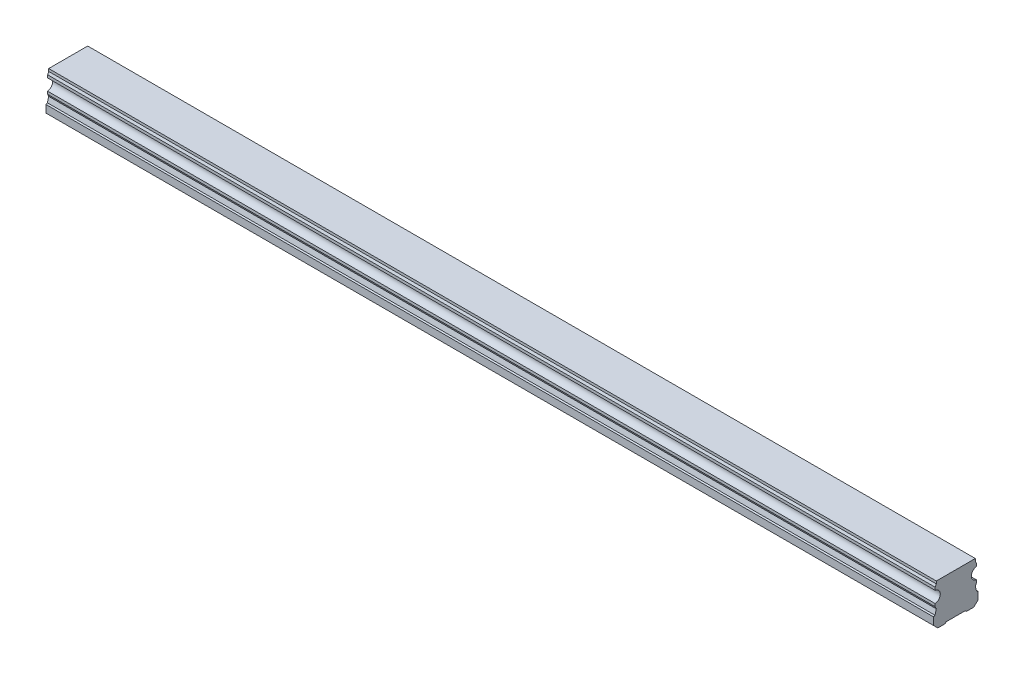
ISO-10303-21;
HEADER;
FILE_DESCRIPTION(('STEP AP214'),'2;1');
FILE_NAME('part.step','',(''),(''),'','','');
FILE_SCHEMA(('AUTOMOTIVE_DESIGN { 1 0 10303 214 1 1 1 1 }'));
ENDSEC;
DATA;
#1=APPLICATION_CONTEXT('core data for automotive mechanical design processes');
#2=APPLICATION_PROTOCOL_DEFINITION('international standard','automotive_design',2000,#1);
#3=PRODUCT_CONTEXT('',#1,'mechanical');
#4=PRODUCT('Part','Part','',(#3));
#5=PRODUCT_RELATED_PRODUCT_CATEGORY('part','',(#4));
#6=PRODUCT_DEFINITION_FORMATION('','',#4);
#7=PRODUCT_DEFINITION_CONTEXT('part definition',#1,'design');
#8=PRODUCT_DEFINITION('design','',#6,#7);
#9=PRODUCT_DEFINITION_SHAPE('','',#8);
#10=(LENGTH_UNIT() NAMED_UNIT(*) SI_UNIT(.MILLI.,.METRE.));
#11=(NAMED_UNIT(*) PLANE_ANGLE_UNIT() SI_UNIT($,.RADIAN.));
#12=(NAMED_UNIT(*) SI_UNIT($,.STERADIAN.) SOLID_ANGLE_UNIT());
#13=UNCERTAINTY_MEASURE_WITH_UNIT(LENGTH_MEASURE(1.E-05),#10,'distance_accuracy_value','');
#14=(GEOMETRIC_REPRESENTATION_CONTEXT(3) GLOBAL_UNCERTAINTY_ASSIGNED_CONTEXT((#13)) GLOBAL_UNIT_ASSIGNED_CONTEXT((#10,
#11,#12)) REPRESENTATION_CONTEXT('',''));
#15=CARTESIAN_POINT('',(0.,0.,0.));
#16=DIRECTION('',(0.,0.,1.));
#17=DIRECTION('',(1.,0.,0.));
#18=AXIS2_PLACEMENT_3D('',#15,#16,#17);
#19=CARTESIAN_POINT('',(270.,0.399999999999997,0.));
#20=DIRECTION('',(0.,-1.,0.));
#21=DIRECTION('',(0.,0.,-1.));
#22=AXIS2_PLACEMENT_3D('',#19,#20,#21);
#23=CONICAL_SURFACE('',#22,2.89999999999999,0.785398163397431);
#24=CARTESIAN_POINT('',(270.,0.799999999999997,0.));
#25=DIRECTION('',(0.,1.,0.));
#26=DIRECTION('',(0.,0.,1.));
#27=AXIS2_PLACEMENT_3D('',#24,#25,#26);
#28=CIRCLE('',#27,2.5);
#29=CARTESIAN_POINT('',(270.,0.799999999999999,2.5));
#30=VERTEX_POINT('',#29);
#31=EDGE_CURVE('E11',#30,#30,#28,.F.);
#32=ORIENTED_EDGE('',*,*,#31,.F.);
#33=EDGE_LOOP('',(#32));
#34=FACE_BOUND('',#33,.T.);
#35=CARTESIAN_POINT('',(270.,0.399999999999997,0.));
#36=DIRECTION('',(0.,1.,0.));
#37=DIRECTION('',(0.,0.,1.));
#38=AXIS2_PLACEMENT_3D('',#35,#36,#37);
#39=CIRCLE('',#38,2.89999999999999);
#40=CARTESIAN_POINT('',(270.,0.399999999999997,2.89999999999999));
#41=VERTEX_POINT('',#40);
#42=EDGE_CURVE('E457',#41,#41,#39,.T.);
#43=ORIENTED_EDGE('',*,*,#42,.F.);
#44=EDGE_LOOP('',(#43));
#45=FACE_BOUND('',#44,.T.);
#46=ADVANCED_FACE('F39',(#34,#45),#23,.F.);
#47=CARTESIAN_POINT('',(270.,7.,0.));
#48=DIRECTION('',(0.,-1.,0.));
#49=DIRECTION('',(0.,0.,-1.));
#50=AXIS2_PLACEMENT_3D('',#47,#48,#49);
#51=CYLINDRICAL_SURFACE('',#50,2.5);
#52=ORIENTED_EDGE('',*,*,#31,.T.);
#53=EDGE_LOOP('',(#52));
#54=FACE_BOUND('',#53,.T.);
#55=CARTESIAN_POINT('',(270.,7.,0.));
#56=DIRECTION('',(0.,-1.,0.));
#57=DIRECTION('',(0.,0.,-1.));
#58=AXIS2_PLACEMENT_3D('',#55,#56,#57);
#59=CIRCLE('',#58,2.5);
#60=CARTESIAN_POINT('',(270.,7.,-2.50000000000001));
#61=VERTEX_POINT('',#60);
#62=EDGE_CURVE('E49',#61,#61,#59,.T.);
#63=ORIENTED_EDGE('',*,*,#62,.F.);
#64=EDGE_LOOP('',(#63));
#65=FACE_BOUND('',#64,.T.);
#66=ADVANCED_FACE('F606',(#54,#65),#51,.F.);
#67=CARTESIAN_POINT('',(270.,7.,0.));
#68=DIRECTION('',(0.,-1.,0.));
#69=DIRECTION('',(0.,0.,-1.));
#70=AXIS2_PLACEMENT_3D('',#67,#68,#69);
#71=PLANE('',#70);
#72=CARTESIAN_POINT('',(270.,7.,0.));
#73=DIRECTION('',(0.,-1.,0.));
#74=DIRECTION('',(0.,0.,-1.));
#75=AXIS2_PLACEMENT_3D('',#72,#73,#74);
#76=CIRCLE('',#75,2.1);
#77=CARTESIAN_POINT('',(270.,7.,-2.1));
#78=VERTEX_POINT('',#77);
#79=EDGE_CURVE('E42',#78,#78,#76,.T.);
#80=ORIENTED_EDGE('',*,*,#79,.F.);
#81=EDGE_LOOP('',(#80));
#82=FACE_BOUND('',#81,.T.);
#83=ORIENTED_EDGE('',*,*,#62,.T.);
#84=EDGE_LOOP('',(#83));
#85=FACE_BOUND('',#84,.T.);
#86=ADVANCED_FACE('F611',(#82,#85),#71,.T.);
#87=CARTESIAN_POINT('',(210.,0.399999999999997,0.));
#88=DIRECTION('',(0.,-1.,0.));
#89=DIRECTION('',(0.,0.,-1.));
#90=AXIS2_PLACEMENT_3D('',#87,#88,#89);
#91=CONICAL_SURFACE('',#90,2.89999999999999,0.785398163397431);
#92=CARTESIAN_POINT('',(210.,0.799999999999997,0.));
#93=DIRECTION('',(0.,1.,0.));
#94=DIRECTION('',(0.,0.,1.));
#95=AXIS2_PLACEMENT_3D('',#92,#93,#94);
#96=CIRCLE('',#95,2.5);
#97=CARTESIAN_POINT('',(210.,0.799999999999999,2.5));
#98=VERTEX_POINT('',#97);
#99=EDGE_CURVE('E453',#98,#98,#96,.F.);
#100=ORIENTED_EDGE('',*,*,#99,.F.);
#101=EDGE_LOOP('',(#100));
#102=FACE_BOUND('',#101,.T.);
#103=CARTESIAN_POINT('',(210.,0.399999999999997,0.));
#104=DIRECTION('',(0.,1.,0.));
#105=DIRECTION('',(0.,0.,1.));
#106=AXIS2_PLACEMENT_3D('',#103,#104,#105);
#107=CIRCLE('',#106,2.89999999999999);
#108=CARTESIAN_POINT('',(210.,0.399999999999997,2.89999999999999));
#109=VERTEX_POINT('',#108);
#110=EDGE_CURVE('E445',#109,#109,#107,.T.);
#111=ORIENTED_EDGE('',*,*,#110,.F.);
#112=EDGE_LOOP('',(#111));
#113=FACE_BOUND('',#112,.T.);
#114=ADVANCED_FACE('F710',(#102,#113),#91,.F.);
#115=CARTESIAN_POINT('',(210.,7.,0.));
#116=DIRECTION('',(0.,-1.,0.));
#117=DIRECTION('',(0.,0.,-1.));
#118=AXIS2_PLACEMENT_3D('',#115,#116,#117);
#119=CYLINDRICAL_SURFACE('',#118,2.5);
#120=ORIENTED_EDGE('',*,*,#99,.T.);
#121=EDGE_LOOP('',(#120));
#122=FACE_BOUND('',#121,.T.);
#123=CARTESIAN_POINT('',(210.,7.,0.));
#124=DIRECTION('',(0.,-1.,0.));
#125=DIRECTION('',(0.,0.,-1.));
#126=AXIS2_PLACEMENT_3D('',#123,#124,#125);
#127=CIRCLE('',#126,2.5);
#128=CARTESIAN_POINT('',(210.,7.,-2.50000000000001));
#129=VERTEX_POINT('',#128);
#130=EDGE_CURVE('E449',#129,#129,#127,.T.);
#131=ORIENTED_EDGE('',*,*,#130,.F.);
#132=EDGE_LOOP('',(#131));
#133=FACE_BOUND('',#132,.T.);
#134=ADVANCED_FACE('F706',(#122,#133),#119,.F.);
#135=CARTESIAN_POINT('',(210.,7.,0.));
#136=DIRECTION('',(0.,-1.,0.));
#137=DIRECTION('',(0.,0.,-1.));
#138=AXIS2_PLACEMENT_3D('',#135,#136,#137);
#139=PLANE('',#138);
#140=CARTESIAN_POINT('',(210.,7.,0.));
#141=DIRECTION('',(0.,-1.,0.));
#142=DIRECTION('',(0.,0.,-1.));
#143=AXIS2_PLACEMENT_3D('',#140,#141,#142);
#144=CIRCLE('',#143,2.1);
#145=CARTESIAN_POINT('',(210.,7.,-2.1));
#146=VERTEX_POINT('',#145);
#147=EDGE_CURVE('E471',#146,#146,#144,.T.);
#148=ORIENTED_EDGE('',*,*,#147,.F.);
#149=EDGE_LOOP('',(#148));
#150=FACE_BOUND('',#149,.T.);
#151=ORIENTED_EDGE('',*,*,#130,.T.);
#152=EDGE_LOOP('',(#151));
#153=FACE_BOUND('',#152,.T.);
#154=ADVANCED_FACE('F702',(#150,#153),#139,.T.);
#155=CARTESIAN_POINT('',(150.,0.399999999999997,0.));
#156=DIRECTION('',(0.,-1.,0.));
#157=DIRECTION('',(0.,0.,-1.));
#158=AXIS2_PLACEMENT_3D('',#155,#156,#157);
#159=CONICAL_SURFACE('',#158,2.89999999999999,0.785398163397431);
#160=CARTESIAN_POINT('',(150.,0.799999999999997,0.));
#161=DIRECTION('',(0.,1.,0.));
#162=DIRECTION('',(0.,0.,1.));
#163=AXIS2_PLACEMENT_3D('',#160,#161,#162);
#164=CIRCLE('',#163,2.5);
#165=CARTESIAN_POINT('',(150.,0.799999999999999,2.5));
#166=VERTEX_POINT('',#165);
#167=EDGE_CURVE('E441',#166,#166,#164,.F.);
#168=ORIENTED_EDGE('',*,*,#167,.F.);
#169=EDGE_LOOP('',(#168));
#170=FACE_BOUND('',#169,.T.);
#171=CARTESIAN_POINT('',(150.,0.399999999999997,0.));
#172=DIRECTION('',(0.,1.,0.));
#173=DIRECTION('',(0.,0.,1.));
#174=AXIS2_PLACEMENT_3D('',#171,#172,#173);
#175=CIRCLE('',#174,2.89999999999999);
#176=CARTESIAN_POINT('',(150.,0.399999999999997,2.89999999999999));
#177=VERTEX_POINT('',#176);
#178=EDGE_CURVE('E433',#177,#177,#175,.T.);
#179=ORIENTED_EDGE('',*,*,#178,.F.);
#180=EDGE_LOOP('',(#179));
#181=FACE_BOUND('',#180,.T.);
#182=ADVANCED_FACE('F698',(#170,#181),#159,.F.);
#183=CARTESIAN_POINT('',(150.,7.,0.));
#184=DIRECTION('',(0.,-1.,0.));
#185=DIRECTION('',(0.,0.,-1.));
#186=AXIS2_PLACEMENT_3D('',#183,#184,#185);
#187=CYLINDRICAL_SURFACE('',#186,2.5);
#188=ORIENTED_EDGE('',*,*,#167,.T.);
#189=EDGE_LOOP('',(#188));
#190=FACE_BOUND('',#189,.T.);
#191=CARTESIAN_POINT('',(150.,7.,0.));
#192=DIRECTION('',(0.,-1.,0.));
#193=DIRECTION('',(0.,0.,-1.));
#194=AXIS2_PLACEMENT_3D('',#191,#192,#193);
#195=CIRCLE('',#194,2.5);
#196=CARTESIAN_POINT('',(150.,7.,-2.50000000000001));
#197=VERTEX_POINT('',#196);
#198=EDGE_CURVE('E437',#197,#197,#195,.T.);
#199=ORIENTED_EDGE('',*,*,#198,.F.);
#200=EDGE_LOOP('',(#199));
#201=FACE_BOUND('',#200,.T.);
#202=ADVANCED_FACE('F694',(#190,#201),#187,.F.);
#203=CARTESIAN_POINT('',(150.,7.,0.));
#204=DIRECTION('',(0.,-1.,0.));
#205=DIRECTION('',(0.,0.,-1.));
#206=AXIS2_PLACEMENT_3D('',#203,#204,#205);
#207=PLANE('',#206);
#208=CARTESIAN_POINT('',(150.,7.,0.));
#209=DIRECTION('',(0.,-1.,0.));
#210=DIRECTION('',(0.,0.,-1.));
#211=AXIS2_PLACEMENT_3D('',#208,#209,#210);
#212=CIRCLE('',#211,2.1);
#213=CARTESIAN_POINT('',(150.,7.,-2.1));
#214=VERTEX_POINT('',#213);
#215=EDGE_CURVE('E467',#214,#214,#212,.T.);
#216=ORIENTED_EDGE('',*,*,#215,.F.);
#217=EDGE_LOOP('',(#216));
#218=FACE_BOUND('',#217,.T.);
#219=ORIENTED_EDGE('',*,*,#198,.T.);
#220=EDGE_LOOP('',(#219));
#221=FACE_BOUND('',#220,.T.);
#222=ADVANCED_FACE('F684',(#218,#221),#207,.T.);
#223=CARTESIAN_POINT('',(300.,14.,-6.59000000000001));
#224=DIRECTION('',(0.,0.,1.));
#225=DIRECTION('',(0.,-1.,0.));
#226=AXIS2_PLACEMENT_3D('',#223,#224,#225);
#227=PLANE('',#226);
#228=DIRECTION('',(0.,1.,0.));
#229=VECTOR('',#228,1.);
#230=CARTESIAN_POINT('',(0.,14.,-6.59000000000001));
#231=LINE('',#230,#229);
#232=CARTESIAN_POINT('',(0.,13.15,-6.59));
#233=VERTEX_POINT('',#232);
#234=CARTESIAN_POINT('',(0.,14.,-6.59000000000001));
#235=VERTEX_POINT('',#234);
#236=EDGE_CURVE('E255',#233,#235,#231,.T.);
#237=ORIENTED_EDGE('',*,*,#236,.T.);
#238=DIRECTION('',(-1.,0.,0.));
#239=VECTOR('',#238,1.);
#240=CARTESIAN_POINT('',(300.,14.,-6.59000000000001));
#241=LINE('',#240,#239);
#242=CARTESIAN_POINT('',(300.,14.,-6.59000000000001));
#243=VERTEX_POINT('',#242);
#244=EDGE_CURVE('E422',#243,#235,#241,.T.);
#245=ORIENTED_EDGE('',*,*,#244,.F.);
#246=DIRECTION('',(0.,1.,0.));
#247=VECTOR('',#246,1.);
#248=CARTESIAN_POINT('',(300.,14.,-6.59000000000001));
#249=LINE('',#248,#247);
#250=CARTESIAN_POINT('',(300.,13.15,-6.59));
#251=VERTEX_POINT('',#250);
#252=EDGE_CURVE('E332',#251,#243,#249,.T.);
#253=ORIENTED_EDGE('',*,*,#252,.F.);
#254=DIRECTION('',(-1.,0.,0.));
#255=VECTOR('',#254,1.);
#256=CARTESIAN_POINT('',(300.,13.15,-6.59));
#257=LINE('',#256,#255);
#258=EDGE_CURVE('E251',#251,#233,#257,.T.);
#259=ORIENTED_EDGE('',*,*,#258,.T.);
#260=EDGE_LOOP('',(#237,#245,#253,#259));
#261=FACE_BOUND('',#260,.T.);
#262=ADVANCED_FACE('F681',(#261),#227,.F.);
#263=CARTESIAN_POINT('',(300.,14.,-6.59000000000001));
#264=DIRECTION('',(0.,-1.,0.));
#265=DIRECTION('',(0.,0.,-1.));
#266=AXIS2_PLACEMENT_3D('',#263,#264,#265);
#267=PLANE('',#266);
#268=DIRECTION('',(0.,0.,1.));
#269=VECTOR('',#268,1.);
#270=CARTESIAN_POINT('',(0.,14.,-6.59000000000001));
#271=LINE('',#270,#269);
#272=CARTESIAN_POINT('',(0.,14.,6.59));
#273=VERTEX_POINT('',#272);
#274=EDGE_CURVE('E259',#235,#273,#271,.T.);
#275=ORIENTED_EDGE('',*,*,#274,.T.);
#276=DIRECTION('',(-1.,0.,0.));
#277=VECTOR('',#276,1.);
#278=CARTESIAN_POINT('',(300.,14.,6.59));
#279=LINE('',#278,#277);
#280=CARTESIAN_POINT('',(300.,14.,6.59));
#281=VERTEX_POINT('',#280);
#282=EDGE_CURVE('E418',#281,#273,#279,.T.);
#283=ORIENTED_EDGE('',*,*,#282,.F.);
#284=DIRECTION('',(0.,0.,1.));
#285=VECTOR('',#284,1.);
#286=CARTESIAN_POINT('',(300.,14.,-6.59000000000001));
#287=LINE('',#286,#285);
#288=EDGE_CURVE('E157',#243,#281,#287,.T.);
#289=ORIENTED_EDGE('',*,*,#288,.F.);
#290=ORIENTED_EDGE('',*,*,#244,.T.);
#291=EDGE_LOOP('',(#275,#283,#289,#290));
#292=FACE_BOUND('',#291,.T.);
#293=ADVANCED_FACE('F677',(#292),#267,.F.);
#294=CARTESIAN_POINT('',(300.,14.,6.59));
#295=DIRECTION('',(0.,0.,-1.));
#296=DIRECTION('',(0.,1.,0.));
#297=AXIS2_PLACEMENT_3D('',#294,#295,#296);
#298=PLANE('',#297);
#299=DIRECTION('',(0.,-1.,0.));
#300=VECTOR('',#299,1.);
#301=CARTESIAN_POINT('',(0.,14.,6.59));
#302=LINE('',#301,#300);
#303=CARTESIAN_POINT('',(0.,13.15,6.59));
#304=VERTEX_POINT('',#303);
#305=EDGE_CURVE('E263',#273,#304,#302,.T.);
#306=ORIENTED_EDGE('',*,*,#305,.T.);
#307=DIRECTION('',(-1.,0.,0.));
#308=VECTOR('',#307,1.);
#309=CARTESIAN_POINT('',(300.,13.15,6.59));
#310=LINE('',#309,#308);
#311=CARTESIAN_POINT('',(300.,13.15,6.59));
#312=VERTEX_POINT('',#311);
#313=EDGE_CURVE('E414',#312,#304,#310,.T.);
#314=ORIENTED_EDGE('',*,*,#313,.F.);
#315=DIRECTION('',(0.,-1.,0.));
#316=VECTOR('',#315,1.);
#317=CARTESIAN_POINT('',(300.,14.,6.59));
#318=LINE('',#317,#316);
#319=EDGE_CURVE('E514',#281,#312,#318,.T.);
#320=ORIENTED_EDGE('',*,*,#319,.F.);
#321=ORIENTED_EDGE('',*,*,#282,.T.);
#322=EDGE_LOOP('',(#306,#314,#320,#321));
#323=FACE_BOUND('',#322,.T.);
#324=ADVANCED_FACE('F673',(#323),#298,.F.);
#325=CARTESIAN_POINT('',(300.,13.15,6.59));
#326=DIRECTION('',(0.,-0.422618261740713,-0.906307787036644));
#327=DIRECTION('',(0.,0.906307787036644,-0.422618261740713));
#328=AXIS2_PLACEMENT_3D('',#325,#326,#327);
#329=PLANE('',#328);
#330=DIRECTION('',(0.,-0.906307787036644,0.422618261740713));
#331=VECTOR('',#330,1.);
#332=CARTESIAN_POINT('',(0.,13.15,6.59));
#333=LINE('',#332,#331);
#334=CARTESIAN_POINT('',(0.,12.3565324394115,6.96));
#335=VERTEX_POINT('',#334);
#336=EDGE_CURVE('E266',#304,#335,#333,.T.);
#337=ORIENTED_EDGE('',*,*,#336,.T.);
#338=DIRECTION('',(-1.,0.,0.));
#339=VECTOR('',#338,1.);
#340=CARTESIAN_POINT('',(300.,12.3565324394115,6.96));
#341=LINE('',#340,#339);
#342=CARTESIAN_POINT('',(300.,12.3565324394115,6.96));
#343=VERTEX_POINT('',#342);
#344=EDGE_CURVE('E410',#343,#335,#341,.T.);
#345=ORIENTED_EDGE('',*,*,#344,.F.);
#346=DIRECTION('',(0.,-0.906307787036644,0.422618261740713));
#347=VECTOR('',#346,1.);
#348=CARTESIAN_POINT('',(300.,13.15,6.59));
#349=LINE('',#348,#347);
#350=EDGE_CURVE('E517',#312,#343,#349,.T.);
#351=ORIENTED_EDGE('',*,*,#350,.F.);
#352=ORIENTED_EDGE('',*,*,#313,.T.);
#353=EDGE_LOOP('',(#337,#345,#351,#352));
#354=FACE_BOUND('',#353,.T.);
#355=ADVANCED_FACE('F669',(#354),#329,.F.);
#356=CARTESIAN_POINT('',(300.,12.3565324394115,6.96));
#357=DIRECTION('',(0.,0.,-1.));
#358=DIRECTION('',(0.,1.,0.));
#359=AXIS2_PLACEMENT_3D('',#356,#357,#358);
#360=PLANE('',#359);
#361=DIRECTION('',(0.,-1.,0.));
#362=VECTOR('',#361,1.);
#363=CARTESIAN_POINT('',(0.,12.3565324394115,6.96));
#364=LINE('',#363,#362);
#365=CARTESIAN_POINT('',(0.,11.4351744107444,6.96));
#366=VERTEX_POINT('',#365);
#367=EDGE_CURVE('E269',#335,#366,#364,.T.);
#368=ORIENTED_EDGE('',*,*,#367,.T.);
#369=DIRECTION('',(-1.,0.,0.));
#370=VECTOR('',#369,1.);
#371=CARTESIAN_POINT('',(300.,11.4351744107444,6.96));
#372=LINE('',#371,#370);
#373=CARTESIAN_POINT('',(300.,11.4351744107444,6.96));
#374=VERTEX_POINT('',#373);
#375=EDGE_CURVE('E406',#374,#366,#372,.T.);
#376=ORIENTED_EDGE('',*,*,#375,.F.);
#377=DIRECTION('',(0.,-1.,0.));
#378=VECTOR('',#377,1.);
#379=CARTESIAN_POINT('',(300.,12.3565324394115,6.96));
#380=LINE('',#379,#378);
#381=EDGE_CURVE('E520',#343,#374,#380,.T.);
#382=ORIENTED_EDGE('',*,*,#381,.F.);
#383=ORIENTED_EDGE('',*,*,#344,.T.);
#384=EDGE_LOOP('',(#368,#376,#382,#383));
#385=FACE_BOUND('',#384,.T.);
#386=ADVANCED_FACE('F665',(#385),#360,.F.);
#387=CARTESIAN_POINT('',(300.,9.5,7.2));
#388=DIRECTION('',(-1.,0.,0.));
#389=DIRECTION('',(0.,0.,1.));
#390=AXIS2_PLACEMENT_3D('',#387,#388,#389);
#391=CYLINDRICAL_SURFACE('',#390,1.95);
#392=CARTESIAN_POINT('',(0.,9.5,7.2));
#393=DIRECTION('',(-1.,0.,0.));
#394=DIRECTION('',(0.,0.,-1.));
#395=AXIS2_PLACEMENT_3D('',#392,#393,#394);
#396=CIRCLE('',#395,1.95);
#397=CARTESIAN_POINT('',(0.,7.56482558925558,6.96));
#398=VERTEX_POINT('',#397);
#399=EDGE_CURVE('E272',#366,#398,#396,.T.);
#400=ORIENTED_EDGE('',*,*,#399,.T.);
#401=DIRECTION('',(-1.,0.,0.));
#402=VECTOR('',#401,1.);
#403=CARTESIAN_POINT('',(300.,7.56482558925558,6.96));
#404=LINE('',#403,#402);
#405=CARTESIAN_POINT('',(300.,7.56482558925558,6.96));
#406=VERTEX_POINT('',#405);
#407=EDGE_CURVE('E402',#406,#398,#404,.T.);
#408=ORIENTED_EDGE('',*,*,#407,.F.);
#409=CARTESIAN_POINT('',(300.,9.5,7.2));
#410=DIRECTION('',(-1.,0.,0.));
#411=DIRECTION('',(0.,0.,-1.));
#412=AXIS2_PLACEMENT_3D('',#409,#410,#411);
#413=CIRCLE('',#412,1.95);
#414=EDGE_CURVE('E523',#374,#406,#413,.T.);
#415=ORIENTED_EDGE('',*,*,#414,.F.);
#416=ORIENTED_EDGE('',*,*,#375,.T.);
#417=EDGE_LOOP('',(#400,#408,#415,#416));
#418=FACE_BOUND('',#417,.T.);
#419=ADVANCED_FACE('F661',(#418),#391,.F.);
#420=CARTESIAN_POINT('',(300.,7.56482558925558,6.96));
#421=DIRECTION('',(0.,0.,-1.));
#422=DIRECTION('',(0.,1.,0.));
#423=AXIS2_PLACEMENT_3D('',#420,#421,#422);
#424=PLANE('',#423);
#425=DIRECTION('',(0.,-1.,0.));
#426=VECTOR('',#425,1.);
#427=CARTESIAN_POINT('',(0.,7.56482558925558,6.96));
#428=LINE('',#427,#426);
#429=CARTESIAN_POINT('',(0.,6.64346756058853,6.96));
#430=VERTEX_POINT('',#429);
#431=EDGE_CURVE('E275',#398,#430,#428,.T.);
#432=ORIENTED_EDGE('',*,*,#431,.T.);
#433=DIRECTION('',(-1.,0.,0.));
#434=VECTOR('',#433,1.);
#435=CARTESIAN_POINT('',(300.,6.64346756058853,6.96));
#436=LINE('',#435,#434);
#437=CARTESIAN_POINT('',(300.,6.64346756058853,6.96));
#438=VERTEX_POINT('',#437);
#439=EDGE_CURVE('E398',#438,#430,#436,.T.);
#440=ORIENTED_EDGE('',*,*,#439,.F.);
#441=DIRECTION('',(0.,-1.,0.));
#442=VECTOR('',#441,1.);
#443=CARTESIAN_POINT('',(300.,7.56482558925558,6.96));
#444=LINE('',#443,#442);
#445=EDGE_CURVE('E525',#406,#438,#444,.T.);
#446=ORIENTED_EDGE('',*,*,#445,.F.);
#447=ORIENTED_EDGE('',*,*,#407,.T.);
#448=EDGE_LOOP('',(#432,#440,#446,#447));
#449=FACE_BOUND('',#448,.T.);
#450=ADVANCED_FACE('F657',(#449),#424,.F.);
#451=CARTESIAN_POINT('',(300.,6.64346756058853,6.96));
#452=DIRECTION('',(0.,0.422618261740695,-0.906307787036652));
#453=DIRECTION('',(0.,0.906307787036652,0.422618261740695));
#454=AXIS2_PLACEMENT_3D('',#451,#452,#453);
#455=PLANE('',#454);
#456=DIRECTION('',(0.,-0.906307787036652,-0.422618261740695));
#457=VECTOR('',#456,1.);
#458=CARTESIAN_POINT('',(0.,6.64346756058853,6.96));
#459=LINE('',#458,#457);
#460=CARTESIAN_POINT('',(0.,5.85,6.59000000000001));
#461=VERTEX_POINT('',#460);
#462=EDGE_CURVE('E278',#430,#461,#459,.T.);
#463=ORIENTED_EDGE('',*,*,#462,.T.);
#464=DIRECTION('',(-1.,0.,0.));
#465=VECTOR('',#464,1.);
#466=CARTESIAN_POINT('',(300.,5.85,6.59000000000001));
#467=LINE('',#466,#465);
#468=CARTESIAN_POINT('',(300.,5.85,6.59000000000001));
#469=VERTEX_POINT('',#468);
#470=EDGE_CURVE('E394',#469,#461,#467,.T.);
#471=ORIENTED_EDGE('',*,*,#470,.F.);
#472=DIRECTION('',(0.,-0.906307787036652,-0.422618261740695));
#473=VECTOR('',#472,1.);
#474=CARTESIAN_POINT('',(300.,6.64346756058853,6.96));
#475=LINE('',#474,#473);
#476=EDGE_CURVE('E528',#438,#469,#475,.T.);
#477=ORIENTED_EDGE('',*,*,#476,.F.);
#478=ORIENTED_EDGE('',*,*,#439,.T.);
#479=EDGE_LOOP('',(#463,#471,#477,#478));
#480=FACE_BOUND('',#479,.T.);
#481=ADVANCED_FACE('F653',(#480),#455,.F.);
#482=CARTESIAN_POINT('',(300.,5.85,6.59000000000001));
#483=DIRECTION('',(0.,-0.25881904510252,-0.965925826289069));
#484=DIRECTION('',(0.,0.965925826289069,-0.25881904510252));
#485=AXIS2_PLACEMENT_3D('',#482,#483,#484);
#486=PLANE('',#485);
#487=DIRECTION('',(0.,-0.965925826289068,0.25881904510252));
#488=VECTOR('',#487,1.);
#489=CARTESIAN_POINT('',(0.,5.85,6.59000000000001));
#490=LINE('',#489,#488);
#491=CARTESIAN_POINT('',(0.,4.2,7.03211616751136));
#492=VERTEX_POINT('',#491);
#493=EDGE_CURVE('E281',#461,#492,#490,.T.);
#494=ORIENTED_EDGE('',*,*,#493,.T.);
#495=DIRECTION('',(-1.,0.,0.));
#496=VECTOR('',#495,1.);
#497=CARTESIAN_POINT('',(300.,4.2,7.03211616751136));
#498=LINE('',#497,#496);
#499=CARTESIAN_POINT('',(300.,4.2,7.03211616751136));
#500=VERTEX_POINT('',#499);
#501=EDGE_CURVE('E390',#500,#492,#498,.T.);
#502=ORIENTED_EDGE('',*,*,#501,.F.);
#503=DIRECTION('',(0.,-0.965925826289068,0.25881904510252));
#504=VECTOR('',#503,1.);
#505=CARTESIAN_POINT('',(300.,5.85,6.59000000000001));
#506=LINE('',#505,#504);
#507=EDGE_CURVE('E531',#469,#500,#506,.T.);
#508=ORIENTED_EDGE('',*,*,#507,.F.);
#509=ORIENTED_EDGE('',*,*,#470,.T.);
#510=EDGE_LOOP('',(#494,#502,#508,#509));
#511=FACE_BOUND('',#510,.T.);
#512=ADVANCED_FACE('F649',(#511),#486,.F.);
#513=CARTESIAN_POINT('',(300.,4.2,7.03211616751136));
#514=DIRECTION('',(0.,-0.866025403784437,-0.500000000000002));
#515=DIRECTION('',(0.,0.500000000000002,-0.866025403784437));
#516=AXIS2_PLACEMENT_3D('',#513,#514,#515);
#517=PLANE('',#516);
#518=DIRECTION('',(0.,-0.500000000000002,0.866025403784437));
#519=VECTOR('',#518,1.);
#520=CARTESIAN_POINT('',(0.,4.2,7.03211616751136));
#521=LINE('',#520,#519);
#522=CARTESIAN_POINT('',(0.,3.92986714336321,7.5));
#523=VERTEX_POINT('',#522);
#524=EDGE_CURVE('E284',#492,#523,#521,.T.);
#525=ORIENTED_EDGE('',*,*,#524,.T.);
#526=DIRECTION('',(-1.,0.,0.));
#527=VECTOR('',#526,1.);
#528=CARTESIAN_POINT('',(300.,3.92986714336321,7.5));
#529=LINE('',#528,#527);
#530=CARTESIAN_POINT('',(300.,3.92986714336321,7.5));
#531=VERTEX_POINT('',#530);
#532=EDGE_CURVE('E386',#531,#523,#529,.T.);
#533=ORIENTED_EDGE('',*,*,#532,.F.);
#534=DIRECTION('',(0.,-0.500000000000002,0.866025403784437));
#535=VECTOR('',#534,1.);
#536=CARTESIAN_POINT('',(300.,4.2,7.03211616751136));
#537=LINE('',#536,#535);
#538=EDGE_CURVE('E534',#500,#531,#537,.T.);
#539=ORIENTED_EDGE('',*,*,#538,.F.);
#540=ORIENTED_EDGE('',*,*,#501,.T.);
#541=EDGE_LOOP('',(#525,#533,#539,#540));
#542=FACE_BOUND('',#541,.T.);
#543=ADVANCED_FACE('F645',(#542),#517,.F.);
#544=CARTESIAN_POINT('',(300.,3.92986714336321,7.5));
#545=DIRECTION('',(0.,0.,-1.));
#546=DIRECTION('',(0.,1.,0.));
#547=AXIS2_PLACEMENT_3D('',#544,#545,#546);
#548=PLANE('',#547);
#549=DIRECTION('',(0.,-1.,0.));
#550=VECTOR('',#549,1.);
#551=CARTESIAN_POINT('',(0.,3.92986714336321,7.5));
#552=LINE('',#551,#550);
#553=CARTESIAN_POINT('',(0.,1.4,7.5));
#554=VERTEX_POINT('',#553);
#555=EDGE_CURVE('E287',#523,#554,#552,.T.);
#556=ORIENTED_EDGE('',*,*,#555,.T.);
#557=DIRECTION('',(-1.,0.,0.));
#558=VECTOR('',#557,1.);
#559=CARTESIAN_POINT('',(300.,1.4,7.5));
#560=LINE('',#559,#558);
#561=CARTESIAN_POINT('',(300.,1.4,7.5));
#562=VERTEX_POINT('',#561);
#563=EDGE_CURVE('E382',#562,#554,#560,.T.);
#564=ORIENTED_EDGE('',*,*,#563,.F.);
#565=DIRECTION('',(0.,-1.,0.));
#566=VECTOR('',#565,1.);
#567=CARTESIAN_POINT('',(300.,3.92986714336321,7.5));
#568=LINE('',#567,#566);
#569=EDGE_CURVE('E537',#531,#562,#568,.T.);
#570=ORIENTED_EDGE('',*,*,#569,.F.);
#571=ORIENTED_EDGE('',*,*,#532,.T.);
#572=EDGE_LOOP('',(#556,#564,#570,#571));
#573=FACE_BOUND('',#572,.T.);
#574=ADVANCED_FACE('F641',(#573),#548,.F.);
#575=CARTESIAN_POINT('',(300.,1.4,7.5));
#576=DIRECTION('',(0.,0.70710678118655,-0.707106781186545));
#577=DIRECTION('',(0.,0.707106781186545,0.70710678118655));
#578=AXIS2_PLACEMENT_3D('',#575,#576,#577);
#579=PLANE('',#578);
#580=DIRECTION('',(0.,-0.707106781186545,-0.70710678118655));
#581=VECTOR('',#580,1.);
#582=CARTESIAN_POINT('',(0.,1.4,7.5));
#583=LINE('',#582,#581);
#584=CARTESIAN_POINT('',(0.,0.,6.1));
#585=VERTEX_POINT('',#584);
#586=EDGE_CURVE('E290',#554,#585,#583,.T.);
#587=ORIENTED_EDGE('',*,*,#586,.T.);
#588=DIRECTION('',(-1.,0.,0.));
#589=VECTOR('',#588,1.);
#590=CARTESIAN_POINT('',(300.,0.,6.1));
#591=LINE('',#590,#589);
#592=CARTESIAN_POINT('',(300.,0.,6.1));
#593=VERTEX_POINT('',#592);
#594=EDGE_CURVE('E378',#593,#585,#591,.T.);
#595=ORIENTED_EDGE('',*,*,#594,.F.);
#596=DIRECTION('',(0.,-0.707106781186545,-0.70710678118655));
#597=VECTOR('',#596,1.);
#598=CARTESIAN_POINT('',(300.,1.4,7.5));
#599=LINE('',#598,#597);
#600=EDGE_CURVE('E540',#562,#593,#599,.T.);
#601=ORIENTED_EDGE('',*,*,#600,.F.);
#602=ORIENTED_EDGE('',*,*,#563,.T.);
#603=EDGE_LOOP('',(#587,#595,#601,#602));
#604=FACE_BOUND('',#603,.T.);
#605=ADVANCED_FACE('F637',(#604),#579,.F.);
#606=CARTESIAN_POINT('',(300.,0.,6.1));
#607=DIRECTION('',(0.,1.,0.));
#608=DIRECTION('',(0.,0.,1.));
#609=AXIS2_PLACEMENT_3D('',#606,#607,#608);
#610=PLANE('',#609);
#611=DIRECTION('',(0.,0.,-1.));
#612=VECTOR('',#611,1.);
#613=CARTESIAN_POINT('',(0.,0.,6.1));
#614=LINE('',#613,#612);
#615=CARTESIAN_POINT('',(0.,0.,3.65));
#616=VERTEX_POINT('',#615);
#617=EDGE_CURVE('E293',#585,#616,#614,.T.);
#618=ORIENTED_EDGE('',*,*,#617,.T.);
#619=DIRECTION('',(-1.,0.,0.));
#620=VECTOR('',#619,1.);
#621=CARTESIAN_POINT('',(300.,0.,3.65));
#622=LINE('',#621,#620);
#623=CARTESIAN_POINT('',(300.,0.,3.65));
#624=VERTEX_POINT('',#623);
#625=EDGE_CURVE('E374',#624,#616,#622,.T.);
#626=ORIENTED_EDGE('',*,*,#625,.F.);
#627=DIRECTION('',(0.,0.,-1.));
#628=VECTOR('',#627,1.);
#629=CARTESIAN_POINT('',(300.,0.,6.1));
#630=LINE('',#629,#628);
#631=EDGE_CURVE('E543',#593,#624,#630,.T.);
#632=ORIENTED_EDGE('',*,*,#631,.F.);
#633=ORIENTED_EDGE('',*,*,#594,.T.);
#634=EDGE_LOOP('',(#618,#626,#632,#633));
#635=FACE_BOUND('',#634,.T.);
#636=ADVANCED_FACE('F629',(#635),#610,.F.);
#637=CARTESIAN_POINT('',(300.,0.,3.65));
#638=DIRECTION('',(0.,0.707106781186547,0.707106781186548));
#639=DIRECTION('',(0.,-0.707106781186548,0.707106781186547));
#640=AXIS2_PLACEMENT_3D('',#637,#638,#639);
#641=PLANE('',#640);
#642=DIRECTION('',(0.,0.707106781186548,-0.707106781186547));
#643=VECTOR('',#642,1.);
#644=CARTESIAN_POINT('',(0.,0.,3.65));
#645=LINE('',#644,#643);
#646=CARTESIAN_POINT('',(0.,0.399999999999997,3.25));
#647=VERTEX_POINT('',#646);
#648=EDGE_CURVE('E296',#616,#647,#645,.T.);
#649=ORIENTED_EDGE('',*,*,#648,.T.);
#650=DIRECTION('',(-1.,0.,0.));
#651=VECTOR('',#650,1.);
#652=CARTESIAN_POINT('',(300.,0.399999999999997,3.25));
#653=LINE('',#652,#651);
#654=CARTESIAN_POINT('',(300.,0.399999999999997,3.25));
#655=VERTEX_POINT('',#654);
#656=EDGE_CURVE('E370',#655,#647,#653,.T.);
#657=ORIENTED_EDGE('',*,*,#656,.F.);
#658=DIRECTION('',(0.,0.707106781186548,-0.707106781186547));
#659=VECTOR('',#658,1.);
#660=CARTESIAN_POINT('',(300.,0.,3.65));
#661=LINE('',#660,#659);
#662=EDGE_CURVE('E546',#624,#655,#661,.T.);
#663=ORIENTED_EDGE('',*,*,#662,.F.);
#664=ORIENTED_EDGE('',*,*,#625,.T.);
#665=EDGE_LOOP('',(#649,#657,#663,#664));
#666=FACE_BOUND('',#665,.T.);
#667=ADVANCED_FACE('F620',(#666),#641,.F.);
#668=CARTESIAN_POINT('',(300.,0.399999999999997,3.25));
#669=DIRECTION('',(0.,1.,0.));
#670=DIRECTION('',(0.,0.,1.));
#671=AXIS2_PLACEMENT_3D('',#668,#669,#670);
#672=PLANE('',#671);
#673=CARTESIAN_POINT('',(90.,0.399999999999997,0.));
#674=DIRECTION('',(0.,1.,0.));
#675=DIRECTION('',(0.,0.,1.));
#676=AXIS2_PLACEMENT_3D('',#673,#674,#675);
#677=CIRCLE('',#676,2.89999999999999);
#678=CARTESIAN_POINT('',(90.,0.399999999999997,2.89999999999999));
#679=VERTEX_POINT('',#678);
#680=EDGE_CURVE('E480',#679,#679,#677,.T.);
#681=ORIENTED_EDGE('',*,*,#680,.T.);
#682=EDGE_LOOP('',(#681));
#683=FACE_BOUND('',#682,.T.);
#684=CARTESIAN_POINT('',(30.,0.399999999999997,0.));
#685=DIRECTION('',(0.,1.,0.));
#686=DIRECTION('',(0.,0.,1.));
#687=AXIS2_PLACEMENT_3D('',#684,#685,#686);
#688=CIRCLE('',#687,2.89999999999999);
#689=CARTESIAN_POINT('',(30.,0.399999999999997,2.89999999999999));
#690=VERTEX_POINT('',#689);
#691=EDGE_CURVE('E425',#690,#690,#688,.T.);
#692=ORIENTED_EDGE('',*,*,#691,.T.);
#693=EDGE_LOOP('',(#692));
#694=FACE_BOUND('',#693,.T.);
#695=DIRECTION('',(0.,0.,-1.));
#696=VECTOR('',#695,1.);
#697=CARTESIAN_POINT('',(0.,0.399999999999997,3.25));
#698=LINE('',#697,#696);
#699=CARTESIAN_POINT('',(0.,0.399999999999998,-3.25));
#700=VERTEX_POINT('',#699);
#701=EDGE_CURVE('E299',#647,#700,#698,.T.);
#702=ORIENTED_EDGE('',*,*,#701,.T.);
#703=DIRECTION('',(-1.,0.,0.));
#704=VECTOR('',#703,1.);
#705=CARTESIAN_POINT('',(300.,0.399999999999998,-3.25));
#706=LINE('',#705,#704);
#707=CARTESIAN_POINT('',(300.,0.399999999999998,-3.25));
#708=VERTEX_POINT('',#707);
#709=EDGE_CURVE('E366',#708,#700,#706,.T.);
#710=ORIENTED_EDGE('',*,*,#709,.F.);
#711=DIRECTION('',(0.,0.,-1.));
#712=VECTOR('',#711,1.);
#713=CARTESIAN_POINT('',(300.,0.399999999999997,3.25));
#714=LINE('',#713,#712);
#715=EDGE_CURVE('E549',#655,#708,#714,.T.);
#716=ORIENTED_EDGE('',*,*,#715,.F.);
#717=ORIENTED_EDGE('',*,*,#656,.T.);
#718=EDGE_LOOP('',(#702,#710,#716,#717));
#719=FACE_BOUND('',#718,.T.);
#720=ORIENTED_EDGE('',*,*,#178,.T.);
#721=EDGE_LOOP('',(#720));
#722=FACE_BOUND('',#721,.T.);
#723=ORIENTED_EDGE('',*,*,#110,.T.);
#724=EDGE_LOOP('',(#723));
#725=FACE_BOUND('',#724,.T.);
#726=ORIENTED_EDGE('',*,*,#42,.T.);
#727=EDGE_LOOP('',(#726));
#728=FACE_BOUND('',#727,.T.);
#729=ADVANCED_FACE('F617',(#683,#694,#719,#722,#725,#728),#672,.F.);
#730=CARTESIAN_POINT('',(300.,0.399999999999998,-3.25));
#731=DIRECTION('',(0.,0.707106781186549,-0.707106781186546));
#732=DIRECTION('',(0.,0.707106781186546,0.707106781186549));
#733=AXIS2_PLACEMENT_3D('',#730,#731,#732);
#734=PLANE('',#733);
#735=DIRECTION('',(0.,-0.707106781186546,-0.707106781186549));
#736=VECTOR('',#735,1.);
#737=CARTESIAN_POINT('',(0.,0.399999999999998,-3.25));
#738=LINE('',#737,#736);
#739=CARTESIAN_POINT('',(0.,0.,-3.65));
#740=VERTEX_POINT('',#739);
#741=EDGE_CURVE('E302',#700,#740,#738,.T.);
#742=ORIENTED_EDGE('',*,*,#741,.T.);
#743=DIRECTION('',(-1.,0.,0.));
#744=VECTOR('',#743,1.);
#745=CARTESIAN_POINT('',(300.,0.,-3.65));
#746=LINE('',#745,#744);
#747=CARTESIAN_POINT('',(300.,0.,-3.65));
#748=VERTEX_POINT('',#747);
#749=EDGE_CURVE('E362',#748,#740,#746,.T.);
#750=ORIENTED_EDGE('',*,*,#749,.F.);
#751=DIRECTION('',(0.,-0.707106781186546,-0.707106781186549));
#752=VECTOR('',#751,1.);
#753=CARTESIAN_POINT('',(300.,0.399999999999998,-3.25));
#754=LINE('',#753,#752);
#755=EDGE_CURVE('E552',#708,#748,#754,.T.);
#756=ORIENTED_EDGE('',*,*,#755,.F.);
#757=ORIENTED_EDGE('',*,*,#709,.T.);
#758=EDGE_LOOP('',(#742,#750,#756,#757));
#759=FACE_BOUND('',#758,.T.);
#760=ADVANCED_FACE('F619',(#759),#734,.F.);
#761=CARTESIAN_POINT('',(300.,0.,-3.65));
#762=DIRECTION('',(0.,1.,0.));
#763=DIRECTION('',(0.,0.,1.));
#764=AXIS2_PLACEMENT_3D('',#761,#762,#763);
#765=PLANE('',#764);
#766=DIRECTION('',(0.,0.,-1.));
#767=VECTOR('',#766,1.);
#768=CARTESIAN_POINT('',(0.,0.,-3.65));
#769=LINE('',#768,#767);
#770=CARTESIAN_POINT('',(0.,0.,-6.1));
#771=VERTEX_POINT('',#770);
#772=EDGE_CURVE('E305',#740,#771,#769,.T.);
#773=ORIENTED_EDGE('',*,*,#772,.T.);
#774=DIRECTION('',(-1.,0.,0.));
#775=VECTOR('',#774,1.);
#776=CARTESIAN_POINT('',(300.,0.,-6.1));
#777=LINE('',#776,#775);
#778=CARTESIAN_POINT('',(300.,0.,-6.1));
#779=VERTEX_POINT('',#778);
#780=EDGE_CURVE('E358',#779,#771,#777,.T.);
#781=ORIENTED_EDGE('',*,*,#780,.F.);
#782=DIRECTION('',(0.,0.,-1.));
#783=VECTOR('',#782,1.);
#784=CARTESIAN_POINT('',(300.,0.,-3.65));
#785=LINE('',#784,#783);
#786=EDGE_CURVE('E555',#748,#779,#785,.T.);
#787=ORIENTED_EDGE('',*,*,#786,.F.);
#788=ORIENTED_EDGE('',*,*,#749,.T.);
#789=EDGE_LOOP('',(#773,#781,#787,#788));
#790=FACE_BOUND('',#789,.T.);
#791=ADVANCED_FACE('F626',(#790),#765,.F.);
#792=CARTESIAN_POINT('',(300.,0.,-6.1));
#793=DIRECTION('',(0.,0.707106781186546,0.707106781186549));
#794=DIRECTION('',(0.,-0.707106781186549,0.707106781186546));
#795=AXIS2_PLACEMENT_3D('',#792,#793,#794);
#796=PLANE('',#795);
#797=DIRECTION('',(0.,0.707106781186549,-0.707106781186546));
#798=VECTOR('',#797,1.);
#799=CARTESIAN_POINT('',(0.,0.,-6.1));
#800=LINE('',#799,#798);
#801=CARTESIAN_POINT('',(0.,1.4,-7.5));
#802=VERTEX_POINT('',#801);
#803=EDGE_CURVE('E308',#771,#802,#800,.T.);
#804=ORIENTED_EDGE('',*,*,#803,.T.);
#805=DIRECTION('',(-1.,0.,0.));
#806=VECTOR('',#805,1.);
#807=CARTESIAN_POINT('',(300.,1.4,-7.5));
#808=LINE('',#807,#806);
#809=CARTESIAN_POINT('',(300.,1.4,-7.5));
#810=VERTEX_POINT('',#809);
#811=EDGE_CURVE('E354',#810,#802,#808,.T.);
#812=ORIENTED_EDGE('',*,*,#811,.F.);
#813=DIRECTION('',(0.,0.707106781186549,-0.707106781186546));
#814=VECTOR('',#813,1.);
#815=CARTESIAN_POINT('',(300.,0.,-6.1));
#816=LINE('',#815,#814);
#817=EDGE_CURVE('E558',#779,#810,#816,.T.);
#818=ORIENTED_EDGE('',*,*,#817,.F.);
#819=ORIENTED_EDGE('',*,*,#780,.T.);
#820=EDGE_LOOP('',(#804,#812,#818,#819));
#821=FACE_BOUND('',#820,.T.);
#822=ADVANCED_FACE('F800',(#821),#796,.F.);
#823=CARTESIAN_POINT('',(300.,1.4,-7.5));
#824=DIRECTION('',(0.,0.,1.));
#825=DIRECTION('',(0.,-1.,0.));
#826=AXIS2_PLACEMENT_3D('',#823,#824,#825);
#827=PLANE('',#826);
#828=DIRECTION('',(0.,1.,0.));
#829=VECTOR('',#828,1.);
#830=CARTESIAN_POINT('',(0.,1.4,-7.5));
#831=LINE('',#830,#829);
#832=CARTESIAN_POINT('',(0.,3.92986714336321,-7.5));
#833=VERTEX_POINT('',#832);
#834=EDGE_CURVE('E311',#802,#833,#831,.T.);
#835=ORIENTED_EDGE('',*,*,#834,.T.);
#836=DIRECTION('',(-1.,0.,0.));
#837=VECTOR('',#836,1.);
#838=CARTESIAN_POINT('',(300.,3.92986714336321,-7.5));
#839=LINE('',#838,#837);
#840=CARTESIAN_POINT('',(300.,3.92986714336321,-7.5));
#841=VERTEX_POINT('',#840);
#842=EDGE_CURVE('E350',#841,#833,#839,.T.);
#843=ORIENTED_EDGE('',*,*,#842,.F.);
#844=DIRECTION('',(0.,1.,0.));
#845=VECTOR('',#844,1.);
#846=CARTESIAN_POINT('',(300.,1.4,-7.5));
#847=LINE('',#846,#845);
#848=EDGE_CURVE('E561',#810,#841,#847,.T.);
#849=ORIENTED_EDGE('',*,*,#848,.F.);
#850=ORIENTED_EDGE('',*,*,#811,.T.);
#851=EDGE_LOOP('',(#835,#843,#849,#850));
#852=FACE_BOUND('',#851,.T.);
#853=ADVANCED_FACE('F808',(#852),#827,.F.);
#854=CARTESIAN_POINT('',(300.,3.92986714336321,-7.5));
#855=DIRECTION('',(0.,-0.866025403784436,0.500000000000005));
#856=DIRECTION('',(0.,-0.500000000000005,-0.866025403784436));
#857=AXIS2_PLACEMENT_3D('',#854,#855,#856);
#858=PLANE('',#857);
#859=DIRECTION('',(0.,0.500000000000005,0.866025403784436));
#860=VECTOR('',#859,1.);
#861=CARTESIAN_POINT('',(0.,3.92986714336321,-7.5));
#862=LINE('',#861,#860);
#863=CARTESIAN_POINT('',(0.,4.2,-7.03211616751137));
#864=VERTEX_POINT('',#863);
#865=EDGE_CURVE('E314',#833,#864,#862,.T.);
#866=ORIENTED_EDGE('',*,*,#865,.T.);
#867=DIRECTION('',(-1.,0.,0.));
#868=VECTOR('',#867,1.);
#869=CARTESIAN_POINT('',(300.,4.2,-7.03211616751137));
#870=LINE('',#869,#868);
#871=CARTESIAN_POINT('',(300.,4.2,-7.03211616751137));
#872=VERTEX_POINT('',#871);
#873=EDGE_CURVE('E347',#872,#864,#870,.T.);
#874=ORIENTED_EDGE('',*,*,#873,.F.);
#875=DIRECTION('',(0.,0.500000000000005,0.866025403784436));
#876=VECTOR('',#875,1.);
#877=CARTESIAN_POINT('',(300.,3.92986714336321,-7.5));
#878=LINE('',#877,#876);
#879=EDGE_CURVE('E564',#841,#872,#878,.T.);
#880=ORIENTED_EDGE('',*,*,#879,.F.);
#881=ORIENTED_EDGE('',*,*,#842,.T.);
#882=EDGE_LOOP('',(#866,#874,#880,#881));
#883=FACE_BOUND('',#882,.T.);
#884=ADVANCED_FACE('F817',(#883),#858,.F.);
#885=CARTESIAN_POINT('',(300.,4.2,-7.03211616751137));
#886=DIRECTION('',(0.,-0.258819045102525,0.965925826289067));
#887=DIRECTION('',(0.,-0.965925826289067,-0.258819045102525));
#888=AXIS2_PLACEMENT_3D('',#885,#886,#887);
#889=PLANE('',#888);
#890=DIRECTION('',(0.,0.965925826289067,0.258819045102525));
#891=VECTOR('',#890,1.);
#892=CARTESIAN_POINT('',(0.,4.2,-7.03211616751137));
#893=LINE('',#892,#891);
#894=CARTESIAN_POINT('',(0.,5.85,-6.59000000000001));
#895=VERTEX_POINT('',#894);
#896=EDGE_CURVE('E317',#864,#895,#893,.T.);
#897=ORIENTED_EDGE('',*,*,#896,.T.);
#898=DIRECTION('',(-1.,0.,0.));
#899=VECTOR('',#898,1.);
#900=CARTESIAN_POINT('',(300.,5.85,-6.59000000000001));
#901=LINE('',#900,#899);
#902=CARTESIAN_POINT('',(300.,5.85,-6.59000000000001));
#903=VERTEX_POINT('',#902);
#904=EDGE_CURVE('E343',#903,#895,#901,.T.);
#905=ORIENTED_EDGE('',*,*,#904,.F.);
#906=DIRECTION('',(0.,0.965925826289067,0.258819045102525));
#907=VECTOR('',#906,1.);
#908=CARTESIAN_POINT('',(300.,4.2,-7.03211616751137));
#909=LINE('',#908,#907);
#910=EDGE_CURVE('E567',#872,#903,#909,.T.);
#911=ORIENTED_EDGE('',*,*,#910,.F.);
#912=ORIENTED_EDGE('',*,*,#873,.T.);
#913=EDGE_LOOP('',(#897,#905,#911,#912));
#914=FACE_BOUND('',#913,.T.);
#915=ADVANCED_FACE('F826',(#914),#889,.F.);
#916=CARTESIAN_POINT('',(300.,5.85,-6.59000000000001));
#917=DIRECTION('',(0.,0.422618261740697,0.906307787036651));
#918=DIRECTION('',(0.,-0.906307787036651,0.422618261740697));
#919=AXIS2_PLACEMENT_3D('',#916,#917,#918);
#920=PLANE('',#919);
#921=DIRECTION('',(0.,0.906307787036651,-0.422618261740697));
#922=VECTOR('',#921,1.);
#923=CARTESIAN_POINT('',(0.,5.85,-6.59000000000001));
#924=LINE('',#923,#922);
#925=CARTESIAN_POINT('',(0.,6.64346756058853,-6.96));
#926=VERTEX_POINT('',#925);
#927=EDGE_CURVE('E320',#895,#926,#924,.T.);
#928=ORIENTED_EDGE('',*,*,#927,.T.);
#929=DIRECTION('',(-1.,0.,0.));
#930=VECTOR('',#929,1.);
#931=CARTESIAN_POINT('',(300.,6.64346756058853,-6.96));
#932=LINE('',#931,#930);
#933=CARTESIAN_POINT('',(300.,6.64346756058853,-6.96));
#934=VERTEX_POINT('',#933);
#935=EDGE_CURVE('E339',#934,#926,#932,.T.);
#936=ORIENTED_EDGE('',*,*,#935,.F.);
#937=DIRECTION('',(0.,0.906307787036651,-0.422618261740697));
#938=VECTOR('',#937,1.);
#939=CARTESIAN_POINT('',(300.,5.85,-6.59000000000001));
#940=LINE('',#939,#938);
#941=EDGE_CURVE('E570',#903,#934,#940,.T.);
#942=ORIENTED_EDGE('',*,*,#941,.F.);
#943=ORIENTED_EDGE('',*,*,#904,.T.);
#944=EDGE_LOOP('',(#928,#936,#942,#943));
#945=FACE_BOUND('',#944,.T.);
#946=ADVANCED_FACE('F835',(#945),#920,.F.);
#947=CARTESIAN_POINT('',(300.,6.64346756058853,-6.96));
#948=DIRECTION('',(0.,0.,1.));
#949=DIRECTION('',(0.,-1.,0.));
#950=AXIS2_PLACEMENT_3D('',#947,#948,#949);
#951=PLANE('',#950);
#952=DIRECTION('',(0.,1.,0.));
#953=VECTOR('',#952,1.);
#954=CARTESIAN_POINT('',(0.,6.64346756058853,-6.96));
#955=LINE('',#954,#953);
#956=CARTESIAN_POINT('',(0.,7.56482558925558,-6.96));
#957=VERTEX_POINT('',#956);
#958=EDGE_CURVE('E323',#926,#957,#955,.T.);
#959=ORIENTED_EDGE('',*,*,#958,.T.);
#960=DIRECTION('',(-1.,0.,0.));
#961=VECTOR('',#960,1.);
#962=CARTESIAN_POINT('',(300.,7.56482558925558,-6.96));
#963=LINE('',#962,#961);
#964=CARTESIAN_POINT('',(300.,7.56482558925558,-6.96));
#965=VERTEX_POINT('',#964);
#966=EDGE_CURVE('E242',#965,#957,#963,.T.);
#967=ORIENTED_EDGE('',*,*,#966,.F.);
#968=DIRECTION('',(0.,1.,0.));
#969=VECTOR('',#968,1.);
#970=CARTESIAN_POINT('',(300.,6.64346756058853,-6.96));
#971=LINE('',#970,#969);
#972=EDGE_CURVE('E231',#934,#965,#971,.T.);
#973=ORIENTED_EDGE('',*,*,#972,.F.);
#974=ORIENTED_EDGE('',*,*,#935,.T.);
#975=EDGE_LOOP('',(#959,#967,#973,#974));
#976=FACE_BOUND('',#975,.T.);
#977=ADVANCED_FACE('F844',(#976),#951,.F.);
#978=CARTESIAN_POINT('',(300.,9.5,-7.2));
#979=DIRECTION('',(-1.,0.,0.));
#980=DIRECTION('',(0.,0.,1.));
#981=AXIS2_PLACEMENT_3D('',#978,#979,#980);
#982=CYLINDRICAL_SURFACE('',#981,1.95);
#983=CARTESIAN_POINT('',(0.,9.5,-7.2));
#984=DIRECTION('',(-1.,0.,0.));
#985=DIRECTION('',(0.,0.,-1.));
#986=AXIS2_PLACEMENT_3D('',#983,#984,#985);
#987=CIRCLE('',#986,1.95);
#988=CARTESIAN_POINT('',(0.,11.4351744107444,-6.96));
#989=VERTEX_POINT('',#988);
#990=EDGE_CURVE('E240',#957,#989,#987,.T.);
#991=ORIENTED_EDGE('',*,*,#990,.T.);
#992=DIRECTION('',(-1.,0.,0.));
#993=VECTOR('',#992,1.);
#994=CARTESIAN_POINT('',(300.,11.4351744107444,-6.96));
#995=LINE('',#994,#993);
#996=CARTESIAN_POINT('',(300.,11.4351744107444,-6.96));
#997=VERTEX_POINT('',#996);
#998=EDGE_CURVE('E237',#997,#989,#995,.T.);
#999=ORIENTED_EDGE('',*,*,#998,.F.);
#1000=CARTESIAN_POINT('',(300.,9.5,-7.2));
#1001=DIRECTION('',(-1.,0.,0.));
#1002=DIRECTION('',(0.,0.,-1.));
#1003=AXIS2_PLACEMENT_3D('',#1000,#1001,#1002);
#1004=CIRCLE('',#1003,1.95);
#1005=EDGE_CURVE('E225',#965,#997,#1004,.T.);
#1006=ORIENTED_EDGE('',*,*,#1005,.F.);
#1007=ORIENTED_EDGE('',*,*,#966,.T.);
#1008=EDGE_LOOP('',(#991,#999,#1006,#1007));
#1009=FACE_BOUND('',#1008,.T.);
#1010=ADVANCED_FACE('F238',(#1009),#982,.F.);
#1011=CARTESIAN_POINT('',(300.,12.3565324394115,-6.96));
#1012=DIRECTION('',(0.,0.,1.));
#1013=DIRECTION('',(0.,-1.,0.));
#1014=AXIS2_PLACEMENT_3D('',#1011,#1012,#1013);
#1015=PLANE('',#1014);
#1016=DIRECTION('',(0.,1.,0.));
#1017=VECTOR('',#1016,1.);
#1018=CARTESIAN_POINT('',(0.,12.3565324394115,-6.96));
#1019=LINE('',#1018,#1017);
#1020=CARTESIAN_POINT('',(0.,12.3565324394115,-6.96));
#1021=VERTEX_POINT('',#1020);
#1022=EDGE_CURVE('E142',#989,#1021,#1019,.T.);
#1023=ORIENTED_EDGE('',*,*,#1022,.T.);
#1024=DIRECTION('',(-1.,0.,0.));
#1025=VECTOR('',#1024,1.);
#1026=CARTESIAN_POINT('',(300.,12.3565324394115,-6.96));
#1027=LINE('',#1026,#1025);
#1028=CARTESIAN_POINT('',(300.,12.3565324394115,-6.96));
#1029=VERTEX_POINT('',#1028);
#1030=EDGE_CURVE('E243',#1029,#1021,#1027,.T.);
#1031=ORIENTED_EDGE('',*,*,#1030,.F.);
#1032=DIRECTION('',(0.,1.,0.));
#1033=VECTOR('',#1032,1.);
#1034=CARTESIAN_POINT('',(300.,12.3565324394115,-6.96));
#1035=LINE('',#1034,#1033);
#1036=EDGE_CURVE('E229',#997,#1029,#1035,.T.);
#1037=ORIENTED_EDGE('',*,*,#1036,.F.);
#1038=ORIENTED_EDGE('',*,*,#998,.T.);
#1039=EDGE_LOOP('',(#1023,#1031,#1037,#1038));
#1040=FACE_BOUND('',#1039,.T.);
#1041=ADVANCED_FACE('F245',(#1040),#1015,.F.);
#1042=CARTESIAN_POINT('',(300.,13.15,-6.59));
#1043=DIRECTION('',(0.,-0.422618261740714,0.906307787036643));
#1044=DIRECTION('',(0.,-0.906307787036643,-0.422618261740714));
#1045=AXIS2_PLACEMENT_3D('',#1042,#1043,#1044);
#1046=PLANE('',#1045);
#1047=DIRECTION('',(0.,0.906307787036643,0.422618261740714));
#1048=VECTOR('',#1047,1.);
#1049=CARTESIAN_POINT('',(0.,13.15,-6.59));
#1050=LINE('',#1049,#1048);
#1051=EDGE_CURVE('E148',#1021,#233,#1050,.T.);
#1052=ORIENTED_EDGE('',*,*,#1051,.T.);
#1053=ORIENTED_EDGE('',*,*,#258,.F.);
#1054=DIRECTION('',(0.,0.906307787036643,0.422618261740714));
#1055=VECTOR('',#1054,1.);
#1056=CARTESIAN_POINT('',(300.,13.15,-6.59));
#1057=LINE('',#1056,#1055);
#1058=EDGE_CURVE('E58',#1029,#251,#1057,.T.);
#1059=ORIENTED_EDGE('',*,*,#1058,.F.);
#1060=ORIENTED_EDGE('',*,*,#1030,.T.);
#1061=EDGE_LOOP('',(#1052,#1053,#1059,#1060));
#1062=FACE_BOUND('',#1061,.T.);
#1063=ADVANCED_FACE('F868',(#1062),#1046,.F.);
#1064=CARTESIAN_POINT('',(300.,9.5,-7.2));
#1065=DIRECTION('',(1.,0.,0.));
#1066=DIRECTION('',(0.,0.,-1.));
#1067=AXIS2_PLACEMENT_3D('',#1064,#1065,#1066);
#1068=PLANE('',#1067);
#1069=ORIENTED_EDGE('',*,*,#252,.T.);
#1070=ORIENTED_EDGE('',*,*,#288,.T.);
#1071=ORIENTED_EDGE('',*,*,#319,.T.);
#1072=ORIENTED_EDGE('',*,*,#350,.T.);
#1073=ORIENTED_EDGE('',*,*,#381,.T.);
#1074=ORIENTED_EDGE('',*,*,#414,.T.);
#1075=ORIENTED_EDGE('',*,*,#445,.T.);
#1076=ORIENTED_EDGE('',*,*,#476,.T.);
#1077=ORIENTED_EDGE('',*,*,#507,.T.);
#1078=ORIENTED_EDGE('',*,*,#538,.T.);
#1079=ORIENTED_EDGE('',*,*,#569,.T.);
#1080=ORIENTED_EDGE('',*,*,#600,.T.);
#1081=ORIENTED_EDGE('',*,*,#631,.T.);
#1082=ORIENTED_EDGE('',*,*,#662,.T.);
#1083=ORIENTED_EDGE('',*,*,#715,.T.);
#1084=ORIENTED_EDGE('',*,*,#755,.T.);
#1085=ORIENTED_EDGE('',*,*,#786,.T.);
#1086=ORIENTED_EDGE('',*,*,#817,.T.);
#1087=ORIENTED_EDGE('',*,*,#848,.T.);
#1088=ORIENTED_EDGE('',*,*,#879,.T.);
#1089=ORIENTED_EDGE('',*,*,#910,.T.);
#1090=ORIENTED_EDGE('',*,*,#941,.T.);
#1091=ORIENTED_EDGE('',*,*,#972,.T.);
#1092=ORIENTED_EDGE('',*,*,#1005,.T.);
#1093=ORIENTED_EDGE('',*,*,#1036,.T.);
#1094=ORIENTED_EDGE('',*,*,#1058,.T.);
#1095=EDGE_LOOP('',(#1069,#1070,#1071,#1072,#1073,#1074,#1075,#1076,#1077,#1078,#1079,#1080,
#1081,#1082,#1083,#1084,#1085,#1086,#1087,#1088,#1089,#1090,#1091,#1092,#1093,#1094));
#1096=FACE_BOUND('',#1095,.T.);
#1097=ADVANCED_FACE('F227',(#1096),#1068,.T.);
#1098=CARTESIAN_POINT('',(0.,9.5,-7.2));
#1099=DIRECTION('',(1.,0.,0.));
#1100=DIRECTION('',(0.,0.,-1.));
#1101=AXIS2_PLACEMENT_3D('',#1098,#1099,#1100);
#1102=PLANE('',#1101);
#1103=ORIENTED_EDGE('',*,*,#236,.F.);
#1104=ORIENTED_EDGE('',*,*,#1051,.F.);
#1105=ORIENTED_EDGE('',*,*,#1022,.F.);
#1106=ORIENTED_EDGE('',*,*,#990,.F.);
#1107=ORIENTED_EDGE('',*,*,#958,.F.);
#1108=ORIENTED_EDGE('',*,*,#927,.F.);
#1109=ORIENTED_EDGE('',*,*,#896,.F.);
#1110=ORIENTED_EDGE('',*,*,#865,.F.);
#1111=ORIENTED_EDGE('',*,*,#834,.F.);
#1112=ORIENTED_EDGE('',*,*,#803,.F.);
#1113=ORIENTED_EDGE('',*,*,#772,.F.);
#1114=ORIENTED_EDGE('',*,*,#741,.F.);
#1115=ORIENTED_EDGE('',*,*,#701,.F.);
#1116=ORIENTED_EDGE('',*,*,#648,.F.);
#1117=ORIENTED_EDGE('',*,*,#617,.F.);
#1118=ORIENTED_EDGE('',*,*,#586,.F.);
#1119=ORIENTED_EDGE('',*,*,#555,.F.);
#1120=ORIENTED_EDGE('',*,*,#524,.F.);
#1121=ORIENTED_EDGE('',*,*,#493,.F.);
#1122=ORIENTED_EDGE('',*,*,#462,.F.);
#1123=ORIENTED_EDGE('',*,*,#431,.F.);
#1124=ORIENTED_EDGE('',*,*,#399,.F.);
#1125=ORIENTED_EDGE('',*,*,#367,.F.);
#1126=ORIENTED_EDGE('',*,*,#336,.F.);
#1127=ORIENTED_EDGE('',*,*,#305,.F.);
#1128=ORIENTED_EDGE('',*,*,#274,.F.);
#1129=EDGE_LOOP('',(#1103,#1104,#1105,#1106,#1107,#1108,#1109,#1110,#1111,#1112,#1113,#1114,
#1115,#1116,#1117,#1118,#1119,#1120,#1121,#1122,#1123,#1124,#1125,#1126,#1127,#1128));
#1130=FACE_BOUND('',#1129,.T.);
#1131=ADVANCED_FACE('F883',(#1130),#1102,.F.);
#1132=CARTESIAN_POINT('',(30.,7.,0.));
#1133=DIRECTION('',(0.,-1.,0.));
#1134=DIRECTION('',(0.,0.,-1.));
#1135=AXIS2_PLACEMENT_3D('',#1132,#1133,#1134);
#1136=CYLINDRICAL_SURFACE('',#1135,2.5);
#1137=CARTESIAN_POINT('',(30.,0.799999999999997,0.));
#1138=DIRECTION('',(0.,1.,0.));
#1139=DIRECTION('',(0.,0.,1.));
#1140=AXIS2_PLACEMENT_3D('',#1137,#1138,#1139);
#1141=CIRCLE('',#1140,2.5);
#1142=CARTESIAN_POINT('',(30.,0.799999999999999,2.5));
#1143=VERTEX_POINT('',#1142);
#1144=EDGE_CURVE('E429',#1143,#1143,#1141,.F.);
#1145=ORIENTED_EDGE('',*,*,#1144,.T.);
#1146=EDGE_LOOP('',(#1145));
#1147=FACE_BOUND('',#1146,.T.);
#1148=CARTESIAN_POINT('',(30.,7.,0.));
#1149=DIRECTION('',(0.,-1.,0.));
#1150=DIRECTION('',(0.,0.,-1.));
#1151=AXIS2_PLACEMENT_3D('',#1148,#1149,#1150);
#1152=CIRCLE('',#1151,2.5);
#1153=CARTESIAN_POINT('',(30.,7.,-2.50000000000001));
#1154=VERTEX_POINT('',#1153);
#1155=EDGE_CURVE('E260',#1154,#1154,#1152,.T.);
#1156=ORIENTED_EDGE('',*,*,#1155,.F.);
#1157=EDGE_LOOP('',(#1156));
#1158=FACE_BOUND('',#1157,.T.);
#1159=ADVANCED_FACE('F891',(#1147,#1158),#1136,.F.);
#1160=CARTESIAN_POINT('',(30.,7.,0.));
#1161=DIRECTION('',(0.,-1.,0.));
#1162=DIRECTION('',(0.,0.,-1.));
#1163=AXIS2_PLACEMENT_3D('',#1160,#1161,#1162);
#1164=PLANE('',#1163);
#1165=CARTESIAN_POINT('',(30.,7.,0.));
#1166=DIRECTION('',(0.,-1.,0.));
#1167=DIRECTION('',(0.,0.,-1.));
#1168=AXIS2_PLACEMENT_3D('',#1165,#1166,#1167);
#1169=CIRCLE('',#1168,2.1);
#1170=CARTESIAN_POINT('',(30.,7.,-2.1));
#1171=VERTEX_POINT('',#1170);
#1172=EDGE_CURVE('E503',#1171,#1171,#1169,.T.);
#1173=ORIENTED_EDGE('',*,*,#1172,.F.);
#1174=EDGE_LOOP('',(#1173));
#1175=FACE_BOUND('',#1174,.T.);
#1176=ORIENTED_EDGE('',*,*,#1155,.T.);
#1177=EDGE_LOOP('',(#1176));
#1178=FACE_BOUND('',#1177,.T.);
#1179=ADVANCED_FACE('F901',(#1175,#1178),#1164,.T.);
#1180=CARTESIAN_POINT('',(30.,9.5,0.));
#1181=DIRECTION('',(0.,-1.,0.));
#1182=DIRECTION('',(0.,0.,-1.));
#1183=AXIS2_PLACEMENT_3D('',#1180,#1181,#1182);
#1184=CYLINDRICAL_SURFACE('',#1183,2.1);
#1185=ORIENTED_EDGE('',*,*,#1172,.T.);
#1186=EDGE_LOOP('',(#1185));
#1187=FACE_BOUND('',#1186,.T.);
#1188=CARTESIAN_POINT('',(30.,9.5,0.));
#1189=DIRECTION('',(0.,-1.,0.));
#1190=DIRECTION('',(0.,0.,-1.));
#1191=AXIS2_PLACEMENT_3D('',#1188,#1189,#1190);
#1192=CIRCLE('',#1191,2.1);
#1193=CARTESIAN_POINT('',(30.,9.5,-2.1));
#1194=VERTEX_POINT('',#1193);
#1195=EDGE_CURVE('E500',#1194,#1194,#1192,.T.);
#1196=ORIENTED_EDGE('',*,*,#1195,.F.);
#1197=EDGE_LOOP('',(#1196));
#1198=FACE_BOUND('',#1197,.T.);
#1199=ADVANCED_FACE('F911',(#1187,#1198),#1184,.F.);
#1200=CARTESIAN_POINT('',(30.,9.5,0.));
#1201=DIRECTION('',(0.,-1.,0.));
#1202=DIRECTION('',(0.,0.,-1.));
#1203=AXIS2_PLACEMENT_3D('',#1200,#1201,#1202);
#1204=CONICAL_SURFACE('',#1203,2.1,1.0471975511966);
#1205=CARTESIAN_POINT('',(30.,10.7124355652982,0.));
#1206=VERTEX_POINT('',#1205);
#1207=VERTEX_LOOP('',#1206);
#1208=FACE_BOUND('',#1207,.T.);
#1209=ORIENTED_EDGE('',*,*,#1195,.T.);
#1210=EDGE_LOOP('',(#1209));
#1211=FACE_BOUND('',#1210,.T.);
#1212=ADVANCED_FACE('F690',(#1208,#1211),#1204,.F.);
#1213=CARTESIAN_POINT('',(30.,0.399999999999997,0.));
#1214=DIRECTION('',(0.,-1.,0.));
#1215=DIRECTION('',(0.,0.,-1.));
#1216=AXIS2_PLACEMENT_3D('',#1213,#1214,#1215);
#1217=CONICAL_SURFACE('',#1216,2.89999999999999,0.785398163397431);
#1218=ORIENTED_EDGE('',*,*,#1144,.F.);
#1219=EDGE_LOOP('',(#1218));
#1220=FACE_BOUND('',#1219,.T.);
#1221=ORIENTED_EDGE('',*,*,#691,.F.);
#1222=EDGE_LOOP('',(#1221));
#1223=FACE_BOUND('',#1222,.T.);
#1224=ADVANCED_FACE('F686',(#1220,#1223),#1217,.F.);
#1225=CARTESIAN_POINT('',(90.,7.,0.));
#1226=DIRECTION('',(0.,-1.,0.));
#1227=DIRECTION('',(0.,0.,-1.));
#1228=AXIS2_PLACEMENT_3D('',#1225,#1226,#1227);
#1229=PLANE('',#1228);
#1230=CARTESIAN_POINT('',(90.,7.,0.));
#1231=DIRECTION('',(0.,-1.,0.));
#1232=DIRECTION('',(0.,0.,-1.));
#1233=AXIS2_PLACEMENT_3D('',#1230,#1231,#1232);
#1234=CIRCLE('',#1233,2.1);
#1235=CARTESIAN_POINT('',(90.,7.,-2.1));
#1236=VERTEX_POINT('',#1235);
#1237=EDGE_CURVE('E463',#1236,#1236,#1234,.T.);
#1238=ORIENTED_EDGE('',*,*,#1237,.F.);
#1239=EDGE_LOOP('',(#1238));
#1240=FACE_BOUND('',#1239,.T.);
#1241=CARTESIAN_POINT('',(90.,7.,0.));
#1242=DIRECTION('',(0.,-1.,0.));
#1243=DIRECTION('',(0.,0.,-1.));
#1244=AXIS2_PLACEMENT_3D('',#1241,#1242,#1243);
#1245=CIRCLE('',#1244,2.5);
#1246=CARTESIAN_POINT('',(90.,7.,-2.50000000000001));
#1247=VERTEX_POINT('',#1246);
#1248=EDGE_CURVE('E491',#1247,#1247,#1245,.T.);
#1249=ORIENTED_EDGE('',*,*,#1248,.T.);
#1250=EDGE_LOOP('',(#1249));
#1251=FACE_BOUND('',#1250,.T.);
#1252=ADVANCED_FACE('F689',(#1240,#1251),#1229,.T.);
#1253=CARTESIAN_POINT('',(90.,7.,0.));
#1254=DIRECTION('',(0.,-1.,0.));
#1255=DIRECTION('',(0.,0.,-1.));
#1256=AXIS2_PLACEMENT_3D('',#1253,#1254,#1255);
#1257=CYLINDRICAL_SURFACE('',#1256,2.5);
#1258=CARTESIAN_POINT('',(90.,0.799999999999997,0.));
#1259=DIRECTION('',(0.,1.,0.));
#1260=DIRECTION('',(0.,0.,1.));
#1261=AXIS2_PLACEMENT_3D('',#1258,#1259,#1260);
#1262=CIRCLE('',#1261,2.5);
#1263=CARTESIAN_POINT('',(90.,0.799999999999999,2.5));
#1264=VERTEX_POINT('',#1263);
#1265=EDGE_CURVE('E485',#1264,#1264,#1262,.F.);
#1266=ORIENTED_EDGE('',*,*,#1265,.T.);
#1267=EDGE_LOOP('',(#1266));
#1268=FACE_BOUND('',#1267,.T.);
#1269=ORIENTED_EDGE('',*,*,#1248,.F.);
#1270=EDGE_LOOP('',(#1269));
#1271=FACE_BOUND('',#1270,.T.);
#1272=ADVANCED_FACE('F939',(#1268,#1271),#1257,.F.);
#1273=CARTESIAN_POINT('',(90.,0.399999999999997,0.));
#1274=DIRECTION('',(0.,-1.,0.));
#1275=DIRECTION('',(0.,0.,-1.));
#1276=AXIS2_PLACEMENT_3D('',#1273,#1274,#1275);
#1277=CONICAL_SURFACE('',#1276,2.89999999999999,0.785398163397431);
#1278=ORIENTED_EDGE('',*,*,#1265,.F.);
#1279=EDGE_LOOP('',(#1278));
#1280=FACE_BOUND('',#1279,.T.);
#1281=ORIENTED_EDGE('',*,*,#680,.F.);
#1282=EDGE_LOOP('',(#1281));
#1283=FACE_BOUND('',#1282,.T.);
#1284=ADVANCED_FACE('F948',(#1280,#1283),#1277,.F.);
#1285=CARTESIAN_POINT('',(90.,9.5,0.));
#1286=DIRECTION('',(0.,-1.,0.));
#1287=DIRECTION('',(0.,0.,-1.));
#1288=AXIS2_PLACEMENT_3D('',#1285,#1286,#1287);
#1289=CYLINDRICAL_SURFACE('',#1288,2.1);
#1290=ORIENTED_EDGE('',*,*,#1237,.T.);
#1291=EDGE_LOOP('',(#1290));
#1292=FACE_BOUND('',#1291,.T.);
#1293=CARTESIAN_POINT('',(90.,9.5,0.));
#1294=DIRECTION('',(0.,-1.,0.));
#1295=DIRECTION('',(0.,0.,-1.));
#1296=AXIS2_PLACEMENT_3D('',#1293,#1294,#1295);
#1297=CIRCLE('',#1296,2.1);
#1298=CARTESIAN_POINT('',(90.,9.5,-2.1));
#1299=VERTEX_POINT('',#1298);
#1300=EDGE_CURVE('E468',#1299,#1299,#1297,.T.);
#1301=ORIENTED_EDGE('',*,*,#1300,.F.);
#1302=EDGE_LOOP('',(#1301));
#1303=FACE_BOUND('',#1302,.T.);
#1304=ADVANCED_FACE('F957',(#1292,#1303),#1289,.F.);
#1305=CARTESIAN_POINT('',(60.,9.5,0.));
#1306=DIRECTION('',(0.,-1.,0.));
#1307=DIRECTION('',(0.,0.,-1.));
#1308=AXIS2_PLACEMENT_3D('',#1305,#1306,#1307);
#1309=PLANE('',#1308);
#1310=ORIENTED_EDGE('',*,*,#1300,.T.);
#1311=EDGE_LOOP('',(#1310));
#1312=FACE_BOUND('',#1311,.T.);
#1313=ADVANCED_FACE('F965',(#1312),#1309,.T.);
#1314=CARTESIAN_POINT('',(150.,9.5,0.));
#1315=DIRECTION('',(0.,-1.,0.));
#1316=DIRECTION('',(0.,0.,-1.));
#1317=AXIS2_PLACEMENT_3D('',#1314,#1315,#1316);
#1318=CYLINDRICAL_SURFACE('',#1317,2.1);
#1319=ORIENTED_EDGE('',*,*,#215,.T.);
#1320=EDGE_LOOP('',(#1319));
#1321=FACE_BOUND('',#1320,.T.);
#1322=CARTESIAN_POINT('',(150.,9.5,0.));
#1323=DIRECTION('',(0.,-1.,0.));
#1324=DIRECTION('',(0.,0.,-1.));
#1325=AXIS2_PLACEMENT_3D('',#1322,#1323,#1324);
#1326=CIRCLE('',#1325,2.1);
#1327=CARTESIAN_POINT('',(150.,9.5,-2.1));
#1328=VERTEX_POINT('',#1327);
#1329=EDGE_CURVE('E575',#1328,#1328,#1326,.T.);
#1330=ORIENTED_EDGE('',*,*,#1329,.F.);
#1331=EDGE_LOOP('',(#1330));
#1332=FACE_BOUND('',#1331,.T.);
#1333=ADVANCED_FACE('F974',(#1321,#1332),#1318,.F.);
#1334=CARTESIAN_POINT('',(120.,9.5,0.));
#1335=DIRECTION('',(0.,-1.,0.));
#1336=DIRECTION('',(0.,0.,-1.));
#1337=AXIS2_PLACEMENT_3D('',#1334,#1335,#1336);
#1338=PLANE('',#1337);
#1339=ORIENTED_EDGE('',*,*,#1329,.T.);
#1340=EDGE_LOOP('',(#1339));
#1341=FACE_BOUND('',#1340,.T.);
#1342=ADVANCED_FACE('F982',(#1341),#1338,.T.);
#1343=CARTESIAN_POINT('',(210.,9.5,0.));
#1344=DIRECTION('',(0.,-1.,0.));
#1345=DIRECTION('',(0.,0.,-1.));
#1346=AXIS2_PLACEMENT_3D('',#1343,#1344,#1345);
#1347=CYLINDRICAL_SURFACE('',#1346,2.1);
#1348=ORIENTED_EDGE('',*,*,#147,.T.);
#1349=EDGE_LOOP('',(#1348));
#1350=FACE_BOUND('',#1349,.T.);
#1351=CARTESIAN_POINT('',(210.,9.5,0.));
#1352=DIRECTION('',(0.,-1.,0.));
#1353=DIRECTION('',(0.,0.,-1.));
#1354=AXIS2_PLACEMENT_3D('',#1351,#1352,#1353);
#1355=CIRCLE('',#1354,2.1);
#1356=CARTESIAN_POINT('',(210.,9.5,-2.1));
#1357=VERTEX_POINT('',#1356);
#1358=EDGE_CURVE('E581',#1357,#1357,#1355,.T.);
#1359=ORIENTED_EDGE('',*,*,#1358,.F.);
#1360=EDGE_LOOP('',(#1359));
#1361=FACE_BOUND('',#1360,.T.);
#1362=ADVANCED_FACE('F602',(#1350,#1361),#1347,.F.);
#1363=CARTESIAN_POINT('',(180.,9.5,0.));
#1364=DIRECTION('',(0.,-1.,0.));
#1365=DIRECTION('',(0.,0.,-1.));
#1366=AXIS2_PLACEMENT_3D('',#1363,#1364,#1365);
#1367=PLANE('',#1366);
#1368=ORIENTED_EDGE('',*,*,#1358,.T.);
#1369=EDGE_LOOP('',(#1368));
#1370=FACE_BOUND('',#1369,.T.);
#1371=ADVANCED_FACE('F595',(#1370),#1367,.T.);
#1372=CARTESIAN_POINT('',(270.,9.5,0.));
#1373=DIRECTION('',(0.,-1.,0.));
#1374=DIRECTION('',(0.,0.,-1.));
#1375=AXIS2_PLACEMENT_3D('',#1372,#1373,#1374);
#1376=CYLINDRICAL_SURFACE('',#1375,2.1);
#1377=ORIENTED_EDGE('',*,*,#79,.T.);
#1378=EDGE_LOOP('',(#1377));
#1379=FACE_BOUND('',#1378,.T.);
#1380=CARTESIAN_POINT('',(270.,9.5,0.));
#1381=DIRECTION('',(0.,-1.,0.));
#1382=DIRECTION('',(0.,0.,-1.));
#1383=AXIS2_PLACEMENT_3D('',#1380,#1381,#1382);
#1384=CIRCLE('',#1383,2.1);
#1385=CARTESIAN_POINT('',(270.,9.5,-2.1));
#1386=VERTEX_POINT('',#1385);
#1387=EDGE_CURVE('E494',#1386,#1386,#1384,.T.);
#1388=ORIENTED_EDGE('',*,*,#1387,.F.);
#1389=EDGE_LOOP('',(#1388));
#1390=FACE_BOUND('',#1389,.T.);
#1391=ADVANCED_FACE('F593',(#1379,#1390),#1376,.F.);
#1392=CARTESIAN_POINT('',(240.,9.5,0.));
#1393=DIRECTION('',(0.,-1.,0.));
#1394=DIRECTION('',(0.,0.,-1.));
#1395=AXIS2_PLACEMENT_3D('',#1392,#1393,#1394);
#1396=PLANE('',#1395);
#1397=ORIENTED_EDGE('',*,*,#1387,.T.);
#1398=EDGE_LOOP('',(#1397));
#1399=FACE_BOUND('',#1398,.T.);
#1400=ADVANCED_FACE('F591',(#1399),#1396,.T.);
#1401=CLOSED_SHELL('',(#46,#66,#86,#114,#134,#154,#182,#202,#222,#262,#293,#324,#355,#386,#419,
#450,#481,#512,#543,#574,#605,#636,#667,#729,#760,#791,#822,#853,#884,#915,#946,#977,#1010,
#1041,#1063,#1097,#1131,#1159,#1179,#1199,#1212,#1224,#1252,#1272,#1284,#1304,#1313,#1333,#1342,
#1362,#1371,#1391,#1400));
#1402=MANIFOLD_SOLID_BREP('B2',#1401);
#1403=ADVANCED_BREP_SHAPE_REPRESENTATION('',(#18,#1402),#14);
#1404=SHAPE_DEFINITION_REPRESENTATION(#9,#1403);
ENDSEC;
END-ISO-10303-21;
